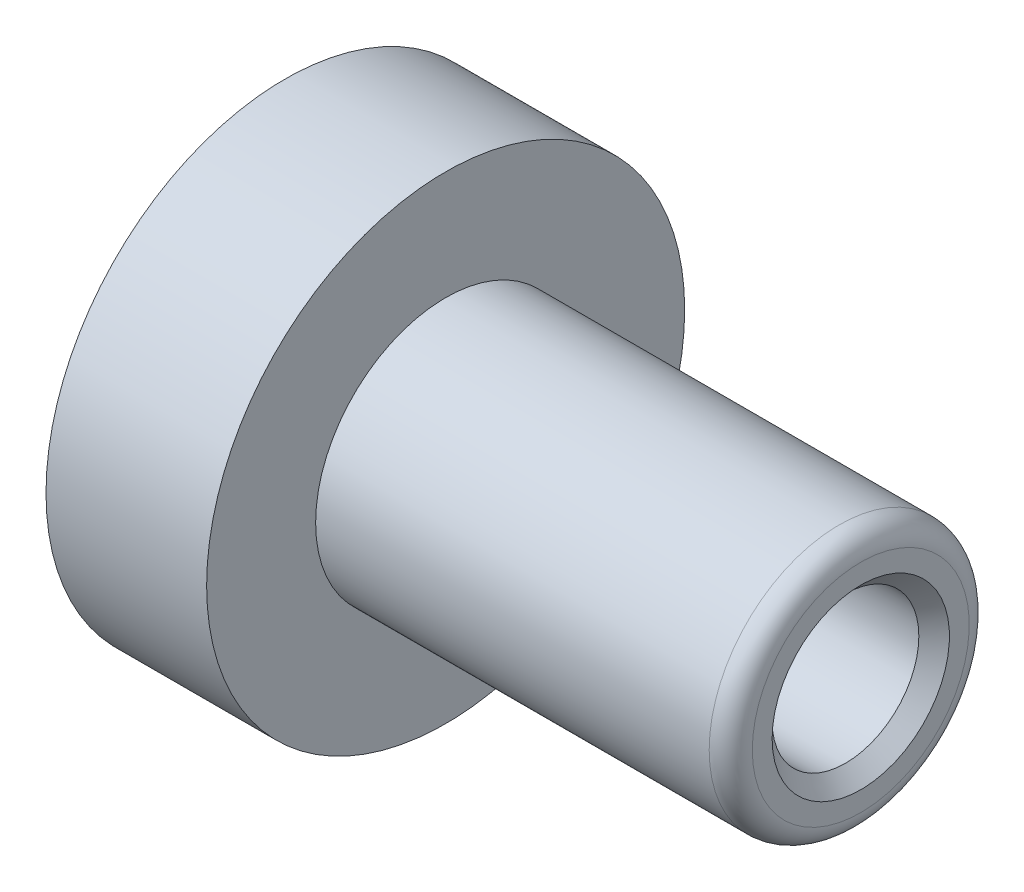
ISO-10303-21;
HEADER;
FILE_DESCRIPTION(('STEP AP214'),'2;1');
FILE_NAME('part.step','',(''),(''),'','','');
FILE_SCHEMA(('AUTOMOTIVE_DESIGN { 1 0 10303 214 1 1 1 1 }'));
ENDSEC;
DATA;
#1=APPLICATION_CONTEXT('core data for automotive mechanical design processes');
#2=APPLICATION_PROTOCOL_DEFINITION('international standard','automotive_design',2000,#1);
#3=PRODUCT_CONTEXT('',#1,'mechanical');
#4=PRODUCT('Part','Part','',(#3));
#5=PRODUCT_RELATED_PRODUCT_CATEGORY('part','',(#4));
#6=PRODUCT_DEFINITION_FORMATION('','',#4);
#7=PRODUCT_DEFINITION_CONTEXT('part definition',#1,'design');
#8=PRODUCT_DEFINITION('design','',#6,#7);
#9=PRODUCT_DEFINITION_SHAPE('','',#8);
#10=(LENGTH_UNIT() NAMED_UNIT(*) SI_UNIT(.MILLI.,.METRE.));
#11=(NAMED_UNIT(*) PLANE_ANGLE_UNIT() SI_UNIT($,.RADIAN.));
#12=(NAMED_UNIT(*) SI_UNIT($,.STERADIAN.) SOLID_ANGLE_UNIT());
#13=UNCERTAINTY_MEASURE_WITH_UNIT(LENGTH_MEASURE(1.E-05),#10,'distance_accuracy_value','');
#14=(GEOMETRIC_REPRESENTATION_CONTEXT(3) GLOBAL_UNCERTAINTY_ASSIGNED_CONTEXT((#13)) GLOBAL_UNIT_ASSIGNED_CONTEXT((#10,
#11,#12)) REPRESENTATION_CONTEXT('',''));
#15=CARTESIAN_POINT('',(0.,0.,0.));
#16=DIRECTION('',(0.,0.,1.));
#17=DIRECTION('',(1.,0.,0.));
#18=AXIS2_PLACEMENT_3D('',#15,#16,#17);
#19=CARTESIAN_POINT('',(0.,0.,0.));
#20=DIRECTION('',(-1.,0.,0.));
#21=DIRECTION('',(0.,0.,1.));
#22=AXIS2_PLACEMENT_3D('',#19,#20,#21);
#23=CYLINDRICAL_SURFACE('',#22,6.7437);
#24=CARTESIAN_POINT('',(20.4724,0.,0.));
#25=DIRECTION('',(-1.,0.,0.));
#26=DIRECTION('',(0.,0.,1.));
#27=AXIS2_PLACEMENT_3D('',#24,#25,#26);
#28=CIRCLE('',#27,6.7437);
#29=CARTESIAN_POINT('',(20.4724,0.,6.7437));
#30=VERTEX_POINT('',#29);
#31=EDGE_CURVE('E42',#30,#30,#28,.T.);
#32=ORIENTED_EDGE('',*,*,#31,.F.);
#33=EDGE_LOOP('',(#32));
#34=FACE_BOUND('',#33,.T.);
#35=CARTESIAN_POINT('',(0.,0.,0.));
#36=DIRECTION('',(-1.,0.,0.));
#37=DIRECTION('',(0.,0.,1.));
#38=AXIS2_PLACEMENT_3D('',#35,#36,#37);
#39=CIRCLE('',#38,6.7437);
#40=CARTESIAN_POINT('',(0.,0.,6.7437));
#41=VERTEX_POINT('',#40);
#42=EDGE_CURVE('E63',#41,#41,#39,.T.);
#43=ORIENTED_EDGE('',*,*,#42,.T.);
#44=EDGE_LOOP('',(#43));
#45=FACE_BOUND('',#44,.T.);
#46=ADVANCED_FACE('F31',(#34,#45),#23,.F.);
#47=CARTESIAN_POINT('',(20.4724,6.7437,0.));
#48=DIRECTION('',(1.,0.,0.));
#49=DIRECTION('',(0.,0.,-1.));
#50=AXIS2_PLACEMENT_3D('',#47,#48,#49);
#51=PLANE('',#50);
#52=ORIENTED_EDGE('',*,*,#31,.T.);
#53=EDGE_LOOP('',(#52));
#54=FACE_BOUND('',#53,.T.);
#55=ADVANCED_FACE('F97',(#54),#51,.F.);
#56=CARTESIAN_POINT('',(42.0624,7.9248,0.));
#57=DIRECTION('',(-1.,0.,0.));
#58=DIRECTION('',(0.,0.,1.));
#59=AXIS2_PLACEMENT_3D('',#56,#57,#58);
#60=PLANE('',#59);
#61=CARTESIAN_POINT('',(42.0624,0.,0.));
#62=DIRECTION('',(-1.,0.,0.));
#63=DIRECTION('',(0.,0.,1.));
#64=AXIS2_PLACEMENT_3D('',#61,#62,#63);
#65=CIRCLE('',#64,6.47699999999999);
#66=CARTESIAN_POINT('',(42.0624,0.,6.47699999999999));
#67=VERTEX_POINT('',#66);
#68=EDGE_CURVE('E10',#67,#67,#65,.T.);
#69=ORIENTED_EDGE('',*,*,#68,.T.);
#70=EDGE_LOOP('',(#69));
#71=FACE_BOUND('',#70,.T.);
#72=CARTESIAN_POINT('',(42.0624,0.,0.));
#73=DIRECTION('',(-1.,0.,0.));
#74=DIRECTION('',(0.,0.,1.));
#75=AXIS2_PLACEMENT_3D('',#72,#73,#74);
#76=CIRCLE('',#75,7.9248);
#77=CARTESIAN_POINT('',(42.0624,0.,7.9248));
#78=VERTEX_POINT('',#77);
#79=EDGE_CURVE('E46',#78,#78,#76,.T.);
#80=ORIENTED_EDGE('',*,*,#79,.F.);
#81=EDGE_LOOP('',(#80));
#82=FACE_BOUND('',#81,.T.);
#83=ADVANCED_FACE('F102',(#71,#82),#60,.F.);
#84=CARTESIAN_POINT('',(40.4876,0.,0.));
#85=DIRECTION('',(-1.,0.,0.));
#86=DIRECTION('',(0.,0.,1.));
#87=AXIS2_PLACEMENT_3D('',#84,#85,#86);
#88=TOROIDAL_SURFACE('',#87,7.9248,1.5748);
#89=CARTESIAN_POINT('',(40.4876,0.,0.));
#90=DIRECTION('',(-1.,0.,0.));
#91=DIRECTION('',(0.,0.,1.));
#92=AXIS2_PLACEMENT_3D('',#89,#90,#91);
#93=CIRCLE('',#92,9.4996);
#94=CARTESIAN_POINT('',(40.4876,0.,9.4996));
#95=VERTEX_POINT('',#94);
#96=EDGE_CURVE('E51',#95,#95,#93,.T.);
#97=ORIENTED_EDGE('',*,*,#96,.F.);
#98=EDGE_LOOP('',(#97));
#99=FACE_BOUND('',#98,.T.);
#100=ORIENTED_EDGE('',*,*,#79,.T.);
#101=EDGE_LOOP('',(#100));
#102=FACE_BOUND('',#101,.T.);
#103=ADVANCED_FACE('F110',(#99,#102),#88,.T.);
#104=CARTESIAN_POINT('',(0.,0.,0.));
#105=DIRECTION('',(-1.,0.,0.));
#106=DIRECTION('',(0.,0.,1.));
#107=AXIS2_PLACEMENT_3D('',#104,#105,#106);
#108=CYLINDRICAL_SURFACE('',#107,9.4996);
#109=CARTESIAN_POINT('',(11.7348,0.,0.));
#110=DIRECTION('',(-1.,0.,0.));
#111=DIRECTION('',(0.,0.,1.));
#112=AXIS2_PLACEMENT_3D('',#109,#110,#111);
#113=CIRCLE('',#112,9.4996);
#114=CARTESIAN_POINT('',(11.7348,0.,9.4996));
#115=VERTEX_POINT('',#114);
#116=EDGE_CURVE('E54',#115,#115,#113,.T.);
#117=ORIENTED_EDGE('',*,*,#116,.F.);
#118=EDGE_LOOP('',(#117));
#119=FACE_BOUND('',#118,.T.);
#120=ORIENTED_EDGE('',*,*,#96,.T.);
#121=EDGE_LOOP('',(#120));
#122=FACE_BOUND('',#121,.T.);
#123=ADVANCED_FACE('F113',(#119,#122),#108,.T.);
#124=CARTESIAN_POINT('',(11.7348,17.4625,0.));
#125=DIRECTION('',(-1.,0.,0.));
#126=DIRECTION('',(0.,0.,1.));
#127=AXIS2_PLACEMENT_3D('',#124,#125,#126);
#128=PLANE('',#127);
#129=CARTESIAN_POINT('',(11.7348,0.,0.));
#130=DIRECTION('',(-1.,0.,0.));
#131=DIRECTION('',(0.,0.,1.));
#132=AXIS2_PLACEMENT_3D('',#129,#130,#131);
#133=CIRCLE('',#132,17.4625);
#134=CARTESIAN_POINT('',(11.7348,0.,17.4625));
#135=VERTEX_POINT('',#134);
#136=EDGE_CURVE('E57',#135,#135,#133,.T.);
#137=ORIENTED_EDGE('',*,*,#136,.F.);
#138=EDGE_LOOP('',(#137));
#139=FACE_BOUND('',#138,.T.);
#140=ORIENTED_EDGE('',*,*,#116,.T.);
#141=EDGE_LOOP('',(#140));
#142=FACE_BOUND('',#141,.T.);
#143=ADVANCED_FACE('F117',(#139,#142),#128,.F.);
#144=CARTESIAN_POINT('',(0.,0.,0.));
#145=DIRECTION('',(-1.,0.,0.));
#146=DIRECTION('',(0.,0.,1.));
#147=AXIS2_PLACEMENT_3D('',#144,#145,#146);
#148=CYLINDRICAL_SURFACE('',#147,17.4625);
#149=CARTESIAN_POINT('',(0.,0.,0.));
#150=DIRECTION('',(-1.,0.,0.));
#151=DIRECTION('',(0.,0.,1.));
#152=AXIS2_PLACEMENT_3D('',#149,#150,#151);
#153=CIRCLE('',#152,17.4625);
#154=CARTESIAN_POINT('',(0.,0.,17.4625));
#155=VERTEX_POINT('',#154);
#156=EDGE_CURVE('E60',#155,#155,#153,.T.);
#157=ORIENTED_EDGE('',*,*,#156,.F.);
#158=EDGE_LOOP('',(#157));
#159=FACE_BOUND('',#158,.T.);
#160=ORIENTED_EDGE('',*,*,#136,.T.);
#161=EDGE_LOOP('',(#160));
#162=FACE_BOUND('',#161,.T.);
#163=ADVANCED_FACE('F121',(#159,#162),#148,.T.);
#164=CARTESIAN_POINT('',(0.,6.7437,0.));
#165=DIRECTION('',(1.,0.,0.));
#166=DIRECTION('',(0.,0.,-1.));
#167=AXIS2_PLACEMENT_3D('',#164,#165,#166);
#168=PLANE('',#167);
#169=CARTESIAN_POINT('',(0.,-11.1125,0.));
#170=DIRECTION('',(-1.,0.,0.));
#171=DIRECTION('',(0.,0.,-1.));
#172=AXIS2_PLACEMENT_3D('',#169,#170,#171);
#173=CIRCLE('',#172,1.6129);
#174=CARTESIAN_POINT('',(0.,-11.1125,-1.6129));
#175=VERTEX_POINT('',#174);
#176=EDGE_CURVE('E73',#175,#175,#173,.T.);
#177=ORIENTED_EDGE('',*,*,#176,.F.);
#178=EDGE_LOOP('',(#177));
#179=FACE_BOUND('',#178,.T.);
#180=CARTESIAN_POINT('',(0.,11.1125,0.));
#181=DIRECTION('',(-1.,0.,0.));
#182=DIRECTION('',(0.,0.,1.));
#183=AXIS2_PLACEMENT_3D('',#180,#181,#182);
#184=CIRCLE('',#183,1.6129);
#185=CARTESIAN_POINT('',(0.,11.1125,1.6129));
#186=VERTEX_POINT('',#185);
#187=EDGE_CURVE('E67',#186,#186,#184,.T.);
#188=ORIENTED_EDGE('',*,*,#187,.F.);
#189=EDGE_LOOP('',(#188));
#190=FACE_BOUND('',#189,.T.);
#191=ORIENTED_EDGE('',*,*,#42,.F.);
#192=EDGE_LOOP('',(#191));
#193=FACE_BOUND('',#192,.T.);
#194=ORIENTED_EDGE('',*,*,#156,.T.);
#195=EDGE_LOOP('',(#194));
#196=FACE_BOUND('',#195,.T.);
#197=ADVANCED_FACE('F125',(#179,#190,#193,#196),#168,.F.);
#198=CARTESIAN_POINT('',(6.35,11.1125,0.));
#199=DIRECTION('',(-1.,0.,0.));
#200=DIRECTION('',(0.,0.,1.));
#201=AXIS2_PLACEMENT_3D('',#198,#199,#200);
#202=CYLINDRICAL_SURFACE('',#201,1.6129);
#203=CARTESIAN_POINT('',(6.35,11.1125,0.));
#204=DIRECTION('',(-1.,0.,0.));
#205=DIRECTION('',(0.,0.,1.));
#206=AXIS2_PLACEMENT_3D('',#203,#204,#205);
#207=CIRCLE('',#206,1.6129);
#208=CARTESIAN_POINT('',(6.35,11.1125,1.6129));
#209=VERTEX_POINT('',#208);
#210=EDGE_CURVE('E66',#209,#209,#207,.T.);
#211=ORIENTED_EDGE('',*,*,#210,.F.);
#212=EDGE_LOOP('',(#211));
#213=FACE_BOUND('',#212,.T.);
#214=ORIENTED_EDGE('',*,*,#187,.T.);
#215=EDGE_LOOP('',(#214));
#216=FACE_BOUND('',#215,.T.);
#217=ADVANCED_FACE('F129',(#213,#216),#202,.F.);
#218=CARTESIAN_POINT('',(6.35,11.1125,0.));
#219=DIRECTION('',(-1.,0.,0.));
#220=DIRECTION('',(0.,0.,1.));
#221=AXIS2_PLACEMENT_3D('',#218,#219,#220);
#222=PLANE('',#221);
#223=ORIENTED_EDGE('',*,*,#210,.T.);
#224=EDGE_LOOP('',(#223));
#225=FACE_BOUND('',#224,.T.);
#226=ADVANCED_FACE('F133',(#225),#222,.T.);
#227=CARTESIAN_POINT('',(6.35,-11.1125,0.));
#228=DIRECTION('',(-1.,0.,0.));
#229=DIRECTION('',(0.,0.,1.));
#230=AXIS2_PLACEMENT_3D('',#227,#228,#229);
#231=CYLINDRICAL_SURFACE('',#230,1.6129);
#232=CARTESIAN_POINT('',(6.35,-11.1125,0.));
#233=DIRECTION('',(-1.,0.,0.));
#234=DIRECTION('',(0.,0.,-1.));
#235=AXIS2_PLACEMENT_3D('',#232,#233,#234);
#236=CIRCLE('',#235,1.6129);
#237=CARTESIAN_POINT('',(6.35,-11.1125,-1.6129));
#238=VERTEX_POINT('',#237);
#239=EDGE_CURVE('E70',#238,#238,#236,.T.);
#240=ORIENTED_EDGE('',*,*,#239,.F.);
#241=EDGE_LOOP('',(#240));
#242=FACE_BOUND('',#241,.T.);
#243=ORIENTED_EDGE('',*,*,#176,.T.);
#244=EDGE_LOOP('',(#243));
#245=FACE_BOUND('',#244,.T.);
#246=ADVANCED_FACE('F93',(#242,#245),#231,.F.);
#247=CARTESIAN_POINT('',(6.35,-11.1125,0.));
#248=DIRECTION('',(1.,0.,0.));
#249=DIRECTION('',(0.,0.,-1.));
#250=AXIS2_PLACEMENT_3D('',#247,#248,#249);
#251=PLANE('',#250);
#252=ORIENTED_EDGE('',*,*,#239,.T.);
#253=EDGE_LOOP('',(#252));
#254=FACE_BOUND('',#253,.T.);
#255=ADVANCED_FACE('F86',(#254),#251,.F.);
#256=CARTESIAN_POINT('',(23.495,0.,0.));
#257=DIRECTION('',(1.,0.,0.));
#258=DIRECTION('',(0.,0.,-1.));
#259=AXIS2_PLACEMENT_3D('',#256,#257,#258);
#260=CYLINDRICAL_SURFACE('',#259,5.3594);
#261=CARTESIAN_POINT('',(40.9448,0.,0.));
#262=DIRECTION('',(-1.,0.,0.));
#263=DIRECTION('',(0.,0.,1.));
#264=AXIS2_PLACEMENT_3D('',#261,#262,#263);
#265=CIRCLE('',#264,5.3594);
#266=CARTESIAN_POINT('',(40.9448,0.,5.3594));
#267=VERTEX_POINT('',#266);
#268=EDGE_CURVE('E38',#267,#267,#265,.F.);
#269=ORIENTED_EDGE('',*,*,#268,.T.);
#270=EDGE_LOOP('',(#269));
#271=FACE_BOUND('',#270,.T.);
#272=CARTESIAN_POINT('',(23.495,0.,0.));
#273=DIRECTION('',(1.,0.,0.));
#274=DIRECTION('',(0.,0.,-1.));
#275=AXIS2_PLACEMENT_3D('',#272,#273,#274);
#276=CIRCLE('',#275,5.3594);
#277=CARTESIAN_POINT('',(23.495,0.,-5.3594));
#278=VERTEX_POINT('',#277);
#279=EDGE_CURVE('E76',#278,#278,#276,.T.);
#280=ORIENTED_EDGE('',*,*,#279,.F.);
#281=EDGE_LOOP('',(#280));
#282=FACE_BOUND('',#281,.T.);
#283=ADVANCED_FACE('F84',(#271,#282),#260,.F.);
#284=CARTESIAN_POINT('',(23.495,0.,0.));
#285=DIRECTION('',(1.,0.,0.));
#286=DIRECTION('',(0.,0.,-1.));
#287=AXIS2_PLACEMENT_3D('',#284,#285,#286);
#288=PLANE('',#287);
#289=ORIENTED_EDGE('',*,*,#279,.T.);
#290=EDGE_LOOP('',(#289));
#291=FACE_BOUND('',#290,.T.);
#292=ADVANCED_FACE('F82',(#291),#288,.T.);
#293=CARTESIAN_POINT('',(40.9448,0.,0.));
#294=DIRECTION('',(1.,0.,0.));
#295=DIRECTION('',(0.,0.,-1.));
#296=AXIS2_PLACEMENT_3D('',#293,#294,#295);
#297=CONICAL_SURFACE('',#296,5.3594,0.785398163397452);
#298=ORIENTED_EDGE('',*,*,#68,.F.);
#299=EDGE_LOOP('',(#298));
#300=FACE_BOUND('',#299,.T.);
#301=ORIENTED_EDGE('',*,*,#268,.F.);
#302=EDGE_LOOP('',(#301));
#303=FACE_BOUND('',#302,.T.);
#304=ADVANCED_FACE('F33',(#300,#303),#297,.F.);
#305=CLOSED_SHELL('',(#46,#55,#83,#103,#123,#143,#163,#197,#217,#226,#246,#255,#283,#292,#304));
#306=MANIFOLD_SOLID_BREP('B2',#305);
#307=ADVANCED_BREP_SHAPE_REPRESENTATION('',(#18,#306),#14);
#308=SHAPE_DEFINITION_REPRESENTATION(#9,#307);
ENDSEC;
END-ISO-10303-21;
